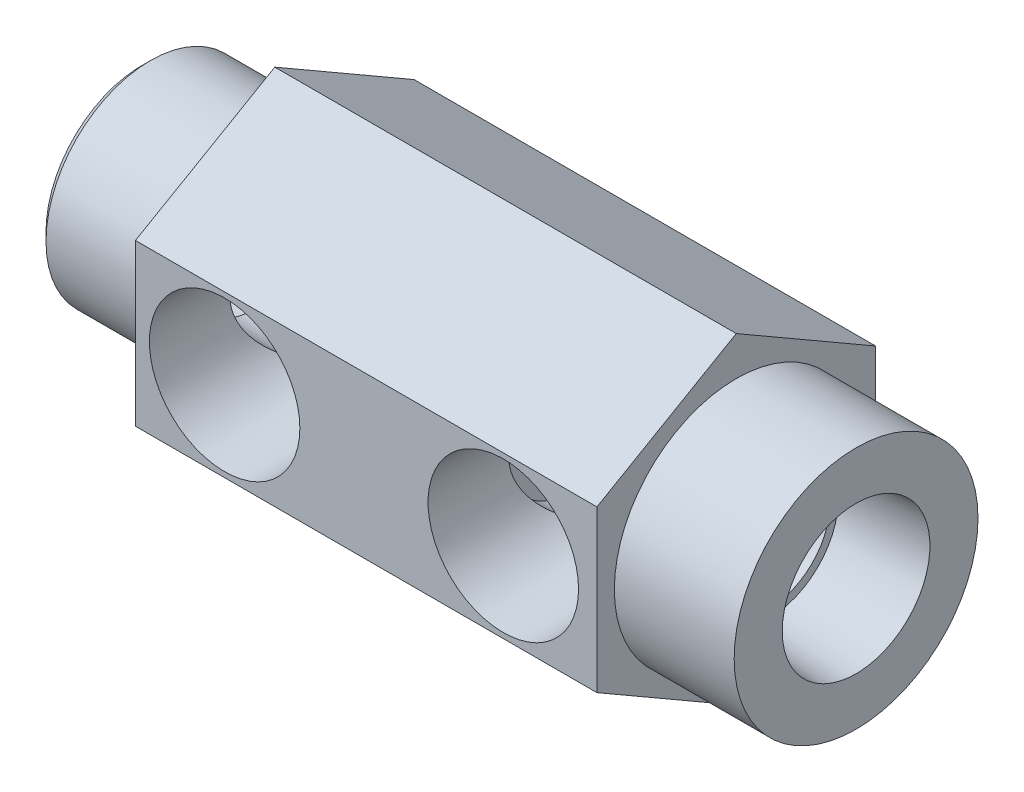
from build123d import *

# Parameters (mm, degrees)
BOSS_EXTRUDE1_DEPTH               = 42.0624
SKETCH2_R                         = 11.1125
BOSS_EXTRUDE2_DEPTH               = 52.9844
SKETCH12_R                        = 9.525
BOSS_EXTRUDE3_DEPTH               = 12.0904
F_1_4_NPT_TAPPED_HOLE1_AT_2_COUNT = 2
F_1_4_NPT_TAPPED_HOLE1_AT_2_PITCH = 25.4
FILLET1_R                         = 1.524
CHAMFER1_SIZE                     = 0.762


with BuildPart() as part:
    # Sketch1 → Boss-Extrude1 (new body)
    with BuildSketch(Plane(origin=(0, 0, 0), x_dir=(0, 0, -1), z_dir=(1, 0, 0))):
        Polygon((-12.7, -7.332348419), (0, -14.664696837), (12.7, -7.332348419), (12.7, 7.332348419), (0, 14.664696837), (-12.7, 7.332348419), align=None)
    extrude(amount=BOSS_EXTRUDE1_DEPTH)

    # Sketch2 → Boss-Extrude2 (add)
    with BuildSketch(Plane(origin=(0, 0, 0), x_dir=(0, 0, -1), z_dir=(1, 0, 0))):
        with Locations(Location((0, 0, 0), (0, 0, 180))):
            Circle(SKETCH2_R)
    extrude(amount=BOSS_EXTRUDE2_DEPTH)

    # Sketch12 → Boss-Extrude3 (add)
    with BuildSketch(Plane.ZY):
        with Locations(Location((0, 0, 0), (0, 0, 180))):
            Circle(SKETCH12_R)
    extrude(amount=BOSS_EXTRUDE3_DEPTH)

    # Sketch7 → 1_4 NPT Tapped Hole1 (revolve, cut)
    with BuildSketch(Plane(origin=(8.128, 0, 12.7), x_dir=(0, -1, 0), z_dir=(1, 0, 0))):
        Polygon((0, 0), (0, 20.411147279), (5.5626, 17.0688), (5.5626, 10.0203), (6.557978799, 10.0203), (6.858, 0), align=None)
    f_1_4_npt_tapped_hole1 = revolve(axis=Axis((8.128, 0, 19.05), (0, 0, -1)), mode=Mode.SUBTRACT)

    # 1_4 NPT Tapped Hole1 at 2: 1_4 NPT Tapped Hole1 ×2
    with Locations(*[(i * F_1_4_NPT_TAPPED_HOLE1_AT_2_PITCH, 0, 0) for i in range(1, F_1_4_NPT_TAPPED_HOLE1_AT_2_COUNT)]):
        add(f_1_4_npt_tapped_hole1, mode=Mode.SUBTRACT)

    # Sketch9 → 1_4 NPT Tapped Hole2 (revolve, cut)
    with BuildSketch(Plane(origin=(8.128, 0, -12.7), x_dir=(0, 1, 0), z_dir=(1, 0, 0))):
        Polygon((0, 0), (0, 20.411147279), (5.5626, 17.0688), (5.5626, 10.0203), (6.557978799, 10.0203), (6.858, 0), align=None)
    revolve(axis=Axis((8.128, 0, -19.05), (0, 0, 1)), mode=Mode.SUBTRACT)

    # Sketch11 → Cut-Revolve1 (revolve, cut)
    with BuildSketch(Plane.XY, mode=Mode.PRIVATE) as cut_revolve1_sk:
        Polygon((52.9844, 6.731), (45.0596, 6.315678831), (45.0596, 5.5499), (26.79065, 5.5499), (26.79065, 0), (52.9844, 0), align=None)
    revolve(cut_revolve1_sk.sketch.rotate(Axis((0, 0, 0), (1, 0, 0)), 90), axis=Axis((0, 0, 0), (1, 0, 0)), mode=Mode.SUBTRACT)

    # Sketch15 → 1_4 NPT Tapped Hole3 (revolve, cut)
    with BuildSketch(Plane(origin=(-12.0904, 0, 0), x_dir=(0, 0, 1), z_dir=(0, 1, 0))):
        Polygon((0, 0), (0, 28.4988), (5.5626, 28.4988), (5.5626, 10.0203), (6.557978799, 10.0203), (6.858, 0), align=None)
    revolve(axis=Axis((-18.4404, 0, 0), (1, 0, 0)), mode=Mode.SUBTRACT)

    # Sketch18 → 1_8 NPT Tapped Hole1 (revolve, cut)
    with BuildSketch(Plane(origin=(16.4084, 0, 0), x_dir=(0, 0, 1), z_dir=(0, 1, 0))):
        Polygon((0, 0), (0, 36.576), (4.2164, 36.576), (4.2164, 6.92404), (4.93618497, 6.92404), (5.1435, 0), align=None)
    revolve(axis=Axis((10.0584, 0, 0), (1, 0, 0)), mode=Mode.SUBTRACT)

    # Fillet1
    fillet1_edges = [part.edges().sort_by_distance(p)[0] for p in [
        (0, 0, 9.525),
    ]]
    fillet(fillet1_edges, radius=FILLET1_R)

    # Chamfer1
    chamfer1_edges = [part.edges().sort_by_distance(p)[0] for p in [
        (-12.0904, 0, 9.525),
    ]]
    chamfer(chamfer1_edges, length=CHAMFER1_SIZE)


solid = part.part
